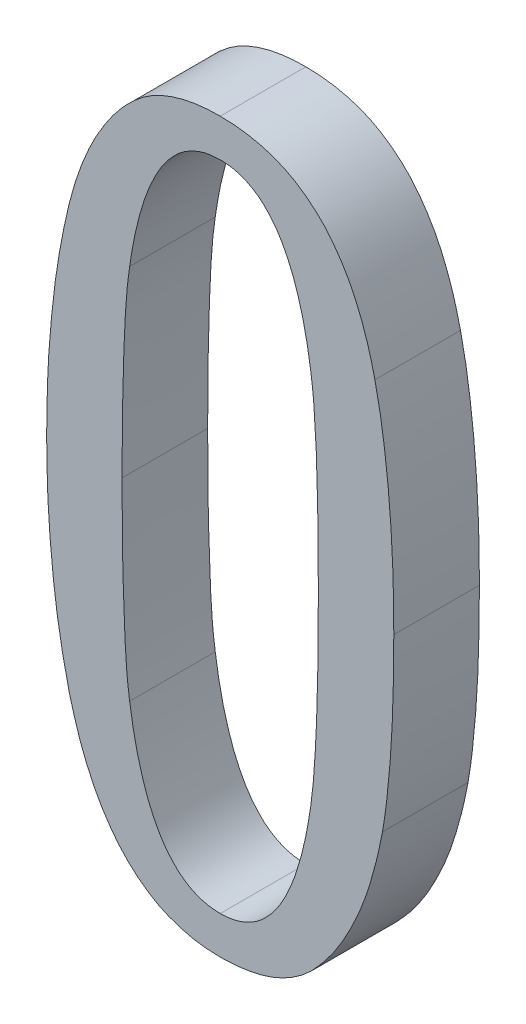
ISO-10303-21;
HEADER;
FILE_DESCRIPTION(('STEP AP214'),'2;1');
FILE_NAME('part.step','',(''),(''),'','','');
FILE_SCHEMA(('AUTOMOTIVE_DESIGN { 1 0 10303 214 1 1 1 1 }'));
ENDSEC;
DATA;
#1=APPLICATION_CONTEXT('core data for automotive mechanical design processes');
#2=APPLICATION_PROTOCOL_DEFINITION('international standard','automotive_design',2000,#1);
#3=PRODUCT_CONTEXT('',#1,'mechanical');
#4=PRODUCT('Part','Part','',(#3));
#5=PRODUCT_RELATED_PRODUCT_CATEGORY('part','',(#4));
#6=PRODUCT_DEFINITION_FORMATION('','',#4);
#7=PRODUCT_DEFINITION_CONTEXT('part definition',#1,'design');
#8=PRODUCT_DEFINITION('design','',#6,#7);
#9=PRODUCT_DEFINITION_SHAPE('','',#8);
#10=(LENGTH_UNIT() NAMED_UNIT(*) SI_UNIT(.MILLI.,.METRE.));
#11=(NAMED_UNIT(*) PLANE_ANGLE_UNIT() SI_UNIT($,.RADIAN.));
#12=(NAMED_UNIT(*) SI_UNIT($,.STERADIAN.) SOLID_ANGLE_UNIT());
#13=UNCERTAINTY_MEASURE_WITH_UNIT(LENGTH_MEASURE(1.E-05),#10,'distance_accuracy_value','');
#14=(GEOMETRIC_REPRESENTATION_CONTEXT(3) GLOBAL_UNCERTAINTY_ASSIGNED_CONTEXT((#13)) GLOBAL_UNIT_ASSIGNED_CONTEXT((#10,
#11,#12)) REPRESENTATION_CONTEXT('',''));
#15=CARTESIAN_POINT('',(0.,0.,0.));
#16=DIRECTION('',(0.,0.,1.));
#17=DIRECTION('',(1.,0.,0.));
#18=AXIS2_PLACEMENT_3D('',#15,#16,#17);
#19=CARTESIAN_POINT('',(6.70570616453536,23.7083022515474,3.));
#20=DIRECTION('',(0.,0.,1.));
#21=DIRECTION('',(1.,0.,0.));
#22=AXIS2_PLACEMENT_3D('',#19,#20,#21);
#23=PLANE('',#22);
#24=CARTESIAN_POINT('',(5.29100529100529,22.8835978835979,3.));
#25=CARTESIAN_POINT('',(5.38712644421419,22.969221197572,3.));
#26=CARTESIAN_POINT('',(5.579058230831,23.1401912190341,3.));
#27=CARTESIAN_POINT('',(5.90109528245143,23.3551879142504,3.));
#28=CARTESIAN_POINT('',(6.24559644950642,23.5381363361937,3.));
#29=CARTESIAN_POINT('',(6.61626051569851,23.6837435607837,3.));
#30=CARTESIAN_POINT('',(7.01047215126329,23.803634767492,3.));
#31=CARTESIAN_POINT('',(7.43083852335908,23.8842611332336,3.));
#32=CARTESIAN_POINT('',(7.87482346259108,23.9351039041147,3.));
#33=CARTESIAN_POINT('',(8.17804962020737,23.9395315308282,3.));
#34=CARTESIAN_POINT('',(8.33333333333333,23.9417989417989,3.));
#35=B_SPLINE_CURVE_WITH_KNOTS('',3,(#24,#25,#26,#27,#28,#29,#30,#31,#32,#33,#34),.UNSPECIFIED.,
.F.,.F.,(4,1,1,1,1,1,1,1,4),(0.,0.116837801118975,0.233298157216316,0.350774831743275,
0.470626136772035,0.594550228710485,0.724619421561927,0.858976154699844,1.),.UNSPECIFIED.);
#36=CARTESIAN_POINT('',(5.29100529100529,22.8835978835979,3.));
#37=VERTEX_POINT('',#36);
#38=CARTESIAN_POINT('',(8.33333333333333,23.9417989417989,3.));
#39=VERTEX_POINT('',#38);
#40=EDGE_CURVE('E333',#37,#39,#35,.T.);
#41=ORIENTED_EDGE('',*,*,#40,.F.);
#42=CARTESIAN_POINT('',(3.04232804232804,18.6507936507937,3.));
#43=CARTESIAN_POINT('',(3.10146166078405,18.8770110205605,3.));
#44=CARTESIAN_POINT('',(3.21690358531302,19.3186374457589,3.));
#45=CARTESIAN_POINT('',(3.43479000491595,19.9507280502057,3.));
#46=CARTESIAN_POINT('',(3.67535329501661,20.5434992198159,3.));
#47=CARTESIAN_POINT('',(3.94143997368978,21.0948392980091,3.));
#48=CARTESIAN_POINT('',(4.23985983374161,21.6034598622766,3.));
#49=CARTESIAN_POINT('',(4.55561703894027,22.075247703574,3.));
#50=CARTESIAN_POINT('',(4.90289521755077,22.5056520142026,3.));
#51=CARTESIAN_POINT('',(5.16268521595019,22.7586383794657,3.));
#52=CARTESIAN_POINT('',(5.29100529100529,22.8835978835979,3.));
#53=B_SPLINE_CURVE_WITH_KNOTS('',3,(#42,#43,#44,#45,#46,#47,#48,#49,#50,#51,#52),.UNSPECIFIED.,
.F.,.F.,(4,1,1,1,1,1,1,1,4),(0.,0.144325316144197,0.281754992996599,0.412450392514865,
0.539168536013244,0.659360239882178,0.776258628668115,0.889485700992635,1.),.UNSPECIFIED.);
#54=CARTESIAN_POINT('',(3.04232804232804,18.6507936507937,3.));
#55=VERTEX_POINT('',#54);
#56=EDGE_CURVE('E233',#55,#37,#53,.T.);
#57=ORIENTED_EDGE('',*,*,#56,.F.);
#58=CARTESIAN_POINT('',(2.24867724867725,11.2433862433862,3.));
#59=CARTESIAN_POINT('',(2.2523405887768,11.5863400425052,3.));
#60=CARTESIAN_POINT('',(2.259564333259,12.2626110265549,3.));
#61=CARTESIAN_POINT('',(2.29157095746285,13.2625863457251,3.));
#62=CARTESIAN_POINT('',(2.35604114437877,14.2329291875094,3.));
#63=CARTESIAN_POINT('',(2.44577096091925,15.1735085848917,3.));
#64=CARTESIAN_POINT('',(2.54969652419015,16.086053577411,3.));
#65=CARTESIAN_POINT('',(2.68913240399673,16.9678309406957,3.));
#66=CARTESIAN_POINT('',(2.84814490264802,17.8213495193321,3.));
#67=CARTESIAN_POINT('',(2.97820314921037,18.3768871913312,3.));
#68=CARTESIAN_POINT('',(3.04232804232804,18.6507936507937,3.));
#69=B_SPLINE_CURVE_WITH_KNOTS('',3,(#58,#59,#60,#61,#62,#63,#64,#65,#66,#67,#68),.UNSPECIFIED.,
.F.,.F.,(4,1,1,1,1,1,1,1,4),(0.,0.13778974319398,0.271707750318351,0.401890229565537,
0.52840892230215,0.651289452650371,0.770803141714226,0.886995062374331,1.),.UNSPECIFIED.);
#70=CARTESIAN_POINT('',(2.24867724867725,11.2433862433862,3.));
#71=VERTEX_POINT('',#70);
#72=EDGE_CURVE('E240',#71,#55,#69,.T.);
#73=ORIENTED_EDGE('',*,*,#72,.F.);
#74=CARTESIAN_POINT('',(3.04232804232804,3.80168528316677,3.));
#75=CARTESIAN_POINT('',(2.97818925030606,4.07886082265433,3.));
#76=CARTESIAN_POINT('',(2.84811789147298,4.64096369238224,3.));
#77=CARTESIAN_POINT('',(2.68964875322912,5.50271863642,3.));
#78=CARTESIAN_POINT('',(2.54963736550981,6.39092234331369,3.));
#79=CARTESIAN_POINT('',(2.44577529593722,7.30837310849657,3.));
#80=CARTESIAN_POINT('',(2.35628269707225,8.25223199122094,3.));
#81=CARTESIAN_POINT('',(2.29153382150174,9.22418298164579,3.));
#82=CARTESIAN_POINT('',(2.25957404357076,10.224162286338,3.));
#83=CARTESIAN_POINT('',(2.25234385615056,10.9004327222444,3.));
#84=CARTESIAN_POINT('',(2.24867724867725,11.2433862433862,3.));
#85=B_SPLINE_CURVE_WITH_KNOTS('',3,(#74,#75,#76,#77,#78,#79,#80,#81,#82,#83,#84),.UNSPECIFIED.,
.F.,.F.,(4,1,1,1,1,1,1,1,4),(0.,0.113770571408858,0.230722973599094,0.350343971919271,
0.473319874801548,0.599919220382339,0.729515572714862,0.862830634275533,1.),.UNSPECIFIED.);
#86=CARTESIAN_POINT('',(3.04232804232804,3.80168528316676,3.));
#87=VERTEX_POINT('',#86);
#88=EDGE_CURVE('E455',#87,#71,#85,.T.);
#89=ORIENTED_EDGE('',*,*,#88,.F.);
#90=CARTESIAN_POINT('',(8.33333333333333,-1.58730158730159,3.));
#91=CARTESIAN_POINT('',(8.17309460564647,-1.58391749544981,3.));
#92=CARTESIAN_POINT('',(7.85620522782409,-1.57722508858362,3.));
#93=CARTESIAN_POINT('',(7.3914557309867,-1.51275868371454,3.));
#94=CARTESIAN_POINT('',(6.94723938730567,-1.40391648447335,3.));
#95=CARTESIAN_POINT('',(6.52435764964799,-1.25574533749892,3.));
#96=CARTESIAN_POINT('',(6.11814491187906,-1.072297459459,3.));
#97=CARTESIAN_POINT('',(5.74075730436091,-0.830361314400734,3.));
#98=CARTESIAN_POINT('',(5.3768998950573,-0.558877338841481,3.));
#99=CARTESIAN_POINT('',(5.03685684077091,-0.239244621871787,3.));
#100=CARTESIAN_POINT('',(4.71167864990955,0.116592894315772,3.));
#101=CARTESIAN_POINT('',(4.41588334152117,0.523504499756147,3.));
#102=CARTESIAN_POINT('',(4.12802809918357,0.963190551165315,3.));
#103=CARTESIAN_POINT('',(3.87156759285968,1.45095805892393,3.));
#104=CARTESIAN_POINT('',(3.63034571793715,1.97723672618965,3.));
#105=CARTESIAN_POINT('',(3.40941112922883,2.54599240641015,3.));
#106=CARTESIAN_POINT('',(3.21614996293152,3.15956885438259,3.));
#107=CARTESIAN_POINT('',(3.10123685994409,3.58406992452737,3.));
#108=CARTESIAN_POINT('',(3.04232804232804,3.80168528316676,3.));
#109=B_SPLINE_CURVE_WITH_KNOTS('',3,(#90,#91,#92,#93,#94,#95,#96,#97,#98,#99,#100,#101,#102,
#103,#104,#105,#106,#107,#108),.UNSPECIFIED.,.F.,.F.,(4,1,1,1,1,1,1,1,1,1,1,1,1,1,1,1,4),(0.,
0.0584826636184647,0.115655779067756,0.170899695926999,0.225208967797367,0.279097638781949,
0.33320030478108,0.388534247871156,0.444649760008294,0.503329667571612,0.564268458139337,
0.628110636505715,0.695067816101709,0.765239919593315,0.839428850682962,0.917685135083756,1.),.UNSPECIFIED.);
#110=CARTESIAN_POINT('',(8.33333333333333,-1.58730158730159,3.));
#111=VERTEX_POINT('',#110);
#112=EDGE_CURVE('E438',#111,#87,#109,.T.);
#113=ORIENTED_EDGE('',*,*,#112,.F.);
#114=CARTESIAN_POINT('',(11.5079365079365,-0.431118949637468,3.));
#115=CARTESIAN_POINT('',(11.4071324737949,-0.523511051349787,3.));
#116=CARTESIAN_POINT('',(11.2050140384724,-0.708763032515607,3.));
#117=CARTESIAN_POINT('',(10.864424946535,-0.939937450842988,3.));
#118=CARTESIAN_POINT('',(10.5060702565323,-1.14502029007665,3.));
#119=CARTESIAN_POINT('',(10.1186919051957,-1.30615067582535,3.));
#120=CARTESIAN_POINT('',(9.70738261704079,-1.43458269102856,3.));
#121=CARTESIAN_POINT('',(9.27019431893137,-1.51983395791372,3.));
#122=CARTESIAN_POINT('',(8.80999708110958,-1.57605002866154,3.));
#123=CARTESIAN_POINT('',(8.49517919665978,-1.58348124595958,3.));
#124=CARTESIAN_POINT('',(8.33333333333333,-1.58730158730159,3.));
#125=B_SPLINE_CURVE_WITH_KNOTS('',3,(#114,#115,#116,#117,#118,#119,#120,#121,#122,#123,#124),
.UNSPECIFIED.,.F.,.F.,(4,1,1,1,1,1,1,1,4),(0.,0.118194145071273,0.236986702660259,
0.355315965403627,0.475013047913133,0.599286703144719,0.727616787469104,0.859969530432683,1.),.UNSPECIFIED.);
#126=CARTESIAN_POINT('',(11.5079365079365,-0.431118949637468,3.));
#127=VERTEX_POINT('',#126);
#128=EDGE_CURVE('E428',#127,#111,#125,.T.);
#129=ORIENTED_EDGE('',*,*,#128,.F.);
#130=CARTESIAN_POINT('',(14.021164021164,5.0607485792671,3.));
#131=CARTESIAN_POINT('',(13.96258083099,4.76762906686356,3.));
#132=CARTESIAN_POINT('',(13.8486262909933,4.19746040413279,3.));
#133=CARTESIAN_POINT('',(13.6240036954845,3.37579721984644,3.));
#134=CARTESIAN_POINT('',(13.3756770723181,2.60469801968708,3.));
#135=CARTESIAN_POINT('',(13.072075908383,1.89200816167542,3.));
#136=CARTESIAN_POINT('',(12.7409484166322,1.22924591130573,3.));
#137=CARTESIAN_POINT('',(12.374467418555,0.618887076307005,3.));
#138=CARTESIAN_POINT('',(11.9662966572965,0.0637231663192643,3.));
#139=CARTESIAN_POINT('',(11.6597204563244,-0.26725415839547,3.));
#140=CARTESIAN_POINT('',(11.5079365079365,-0.431118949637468,3.));
#141=B_SPLINE_CURVE_WITH_KNOTS('',3,(#130,#131,#132,#133,#134,#135,#136,#137,#138,#139,#140),
.UNSPECIFIED.,.F.,.F.,(4,1,1,1,1,1,1,1,4),(0.,0.146296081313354,0.284571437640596,
0.416795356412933,0.542560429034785,0.663408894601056,0.779267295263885,0.890716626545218,1.),.UNSPECIFIED.);
#142=CARTESIAN_POINT('',(14.021164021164,5.0607485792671,3.));
#143=VERTEX_POINT('',#142);
#144=EDGE_CURVE('E418',#143,#127,#141,.T.);
#145=ORIENTED_EDGE('',*,*,#144,.F.);
#146=CARTESIAN_POINT('',(14.4179894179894,11.2433862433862,3.));
#147=CARTESIAN_POINT('',(14.4175924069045,10.9249315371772,3.));
#148=CARTESIAN_POINT('',(14.4168186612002,10.3042864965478,3.));
#149=CARTESIAN_POINT('',(14.3951539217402,9.39955885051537,3.));
#150=CARTESIAN_POINT('',(14.367979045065,8.54688392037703,3.));
#151=CARTESIAN_POINT('',(14.3244280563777,7.74808456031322,3.));
#152=CARTESIAN_POINT('',(14.2648680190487,7.00178879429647,3.));
#153=CARTESIAN_POINT('',(14.1964763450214,6.30764001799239,3.));
#154=CARTESIAN_POINT('',(14.1216673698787,5.66485327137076,3.));
#155=CARTESIAN_POINT('',(14.0537289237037,5.25648942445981,3.));
#156=CARTESIAN_POINT('',(14.021164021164,5.0607485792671,3.));
#157=B_SPLINE_CURVE_WITH_KNOTS('',3,(#146,#147,#148,#149,#150,#151,#152,#153,#154,#155,#156),
.UNSPECIFIED.,.F.,.F.,(4,1,1,1,1,1,1,1,4),(0.,0.15402714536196,0.300187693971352,
0.437707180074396,0.566652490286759,0.687086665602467,0.799792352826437,0.904034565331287,1.),.UNSPECIFIED.);
#158=CARTESIAN_POINT('',(14.4179894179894,11.2433862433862,3.));
#159=VERTEX_POINT('',#158);
#160=EDGE_CURVE('E412',#159,#143,#157,.T.);
#161=ORIENTED_EDGE('',*,*,#160,.F.);
#162=CARTESIAN_POINT('',(13.7566137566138,18.6507936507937,3.));
#163=CARTESIAN_POINT('',(13.8111762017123,18.3964788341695,3.));
#164=CARTESIAN_POINT('',(13.923361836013,17.873583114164,3.));
#165=CARTESIAN_POINT('',(14.0510187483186,17.0602784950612,3.));
#166=CARTESIAN_POINT('',(14.1642109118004,16.2027261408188,3.));
#167=CARTESIAN_POINT('',(14.2568370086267,15.2992500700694,3.));
#168=CARTESIAN_POINT('',(14.3292473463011,14.3501203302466,3.));
#169=CARTESIAN_POINT('',(14.3841461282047,13.3554489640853,3.));
#170=CARTESIAN_POINT('',(14.4123119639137,12.3148196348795,3.));
#171=CARTESIAN_POINT('',(14.4160683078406,11.6059328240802,3.));
#172=CARTESIAN_POINT('',(14.4179894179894,11.2433862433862,3.));
#173=B_SPLINE_CURVE_WITH_KNOTS('',3,(#162,#163,#164,#165,#166,#167,#168,#169,#170,#171,#172),
.UNSPECIFIED.,.F.,.F.,(4,1,1,1,1,1,1,1,4),(0.,0.104707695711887,0.215289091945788,
0.331343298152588,0.452968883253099,0.580907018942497,0.714577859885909,0.854026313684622,1.),.UNSPECIFIED.);
#174=CARTESIAN_POINT('',(13.7566137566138,18.6507936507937,3.));
#175=VERTEX_POINT('',#174);
#176=EDGE_CURVE('E379',#175,#159,#173,.T.);
#177=ORIENTED_EDGE('',*,*,#176,.F.);
#178=CARTESIAN_POINT('',(8.33333333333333,23.9417989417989,3.));
#179=CARTESIAN_POINT('',(8.50666388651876,23.9387479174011,3.));
#180=CARTESIAN_POINT('',(8.84477249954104,23.932796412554,3.));
#181=CARTESIAN_POINT('',(9.33958897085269,23.8654089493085,3.));
#182=CARTESIAN_POINT('',(9.81026725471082,23.7638582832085,3.));
#183=CARTESIAN_POINT('',(10.2595231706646,23.6226580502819,3.));
#184=CARTESIAN_POINT('',(10.6841825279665,23.4339184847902,3.));
#185=CARTESIAN_POINT('',(11.0855142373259,23.205052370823,3.));
#186=CARTESIAN_POINT('',(11.4604886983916,22.930869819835,3.));
#187=CARTESIAN_POINT('',(11.8158069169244,22.6221606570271,3.));
#188=CARTESIAN_POINT('',(12.1437942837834,22.2687753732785,3.));
#189=CARTESIAN_POINT('',(12.4428248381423,21.8721266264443,3.));
#190=CARTESIAN_POINT('',(12.7231567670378,21.4385286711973,3.));
#191=CARTESIAN_POINT('',(12.9846407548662,20.9639741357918,3.));
#192=CARTESIAN_POINT('',(13.2104343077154,20.4413501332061,3.));
#193=CARTESIAN_POINT('',(13.4239584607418,19.8840661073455,3.));
#194=CARTESIAN_POINT('',(13.603610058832,19.2819500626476,3.));
#195=CARTESIAN_POINT('',(13.7046371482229,18.8652026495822,3.));
#196=CARTESIAN_POINT('',(13.7566137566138,18.6507936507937,3.));
#197=B_SPLINE_CURVE_WITH_KNOTS('',3,(#178,#179,#180,#181,#182,#183,#184,#185,#186,#187,#188,
#189,#190,#191,#192,#193,#194,#195,#196),.UNSPECIFIED.,.F.,.F.,(4,1,1,1,1,1,1,1,1,1,1,1,1,1,1,1,
4),(0.,0.0626395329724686,0.122188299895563,0.180218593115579,0.236618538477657,
0.292139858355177,0.347952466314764,0.403351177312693,0.459846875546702,0.517925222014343,
0.577333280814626,0.63924769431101,0.704520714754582,0.772992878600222,0.844941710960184,
0.920225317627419,1.),.UNSPECIFIED.);
#198=EDGE_CURVE('E376',#39,#175,#197,.T.);
#199=ORIENTED_EDGE('',*,*,#198,.F.);
#200=EDGE_LOOP('',(#41,#57,#73,#89,#113,#129,#145,#161,#177,#199));
#201=FACE_BOUND('',#200,.T.);
#202=CARTESIAN_POINT('',(8.33333333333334,-0.264550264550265,3.));
#203=CARTESIAN_POINT('',(8.43491832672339,-0.261050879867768,3.));
#204=CARTESIAN_POINT('',(8.63494746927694,-0.254160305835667,3.));
#205=CARTESIAN_POINT('',(8.92584610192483,-0.19161095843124,3.));
#206=CARTESIAN_POINT('',(9.20400210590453,-0.100088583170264,3.));
#207=CARTESIAN_POINT('',(9.46639085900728,0.0362471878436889,3.));
#208=CARTESIAN_POINT('',(9.71753440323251,0.206103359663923,3.));
#209=CARTESIAN_POINT('',(9.94727835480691,0.422677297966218,3.));
#210=CARTESIAN_POINT('',(10.1703467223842,0.667523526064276,3.));
#211=CARTESIAN_POINT('',(10.3754299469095,0.954487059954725,3.));
#212=CARTESIAN_POINT('',(10.5669930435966,1.27918444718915,3.));
#213=CARTESIAN_POINT('',(10.7400072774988,1.64347158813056,3.));
#214=CARTESIAN_POINT('',(10.9103159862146,2.03999433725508,3.));
#215=CARTESIAN_POINT('',(11.0530555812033,2.47949386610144,3.));
#216=CARTESIAN_POINT('',(11.1920345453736,2.95414135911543,3.));
#217=CARTESIAN_POINT('',(11.3122491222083,3.4680146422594,3.));
#218=CARTESIAN_POINT('',(11.4213373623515,4.0185219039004,3.));
#219=CARTESIAN_POINT('',(11.4784756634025,4.39910512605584,3.));
#220=CARTESIAN_POINT('',(11.5079365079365,4.59533607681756,3.));
#221=B_SPLINE_CURVE_WITH_KNOTS('',3,(#202,#203,#204,#205,#206,#207,#208,#209,#210,#211,#212,
#213,#214,#215,#216,#217,#218,#219,#220),.UNSPECIFIED.,.F.,.F.,(4,1,1,1,1,1,1,1,1,1,1,1,1,1,1,1,
4),(0.,0.0481380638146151,0.0947877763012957,0.140606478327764,0.18669299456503,
0.234618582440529,0.283975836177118,0.336095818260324,0.391579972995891,0.450978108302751,
0.514738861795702,0.582803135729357,0.655573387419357,0.733798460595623,0.817427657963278,
0.905864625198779,1.),.UNSPECIFIED.);
#222=CARTESIAN_POINT('',(8.33333333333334,-0.264550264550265,3.));
#223=VERTEX_POINT('',#222);
#224=CARTESIAN_POINT('',(11.5079365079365,4.59533607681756,3.));
#225=VERTEX_POINT('',#224);
#226=EDGE_CURVE('E176',#223,#225,#221,.T.);
#227=ORIENTED_EDGE('',*,*,#226,.F.);
#228=CARTESIAN_POINT('',(5.15873015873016,4.59533607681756,3.));
#229=CARTESIAN_POINT('',(5.18819100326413,4.39910512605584,3.));
#230=CARTESIAN_POINT('',(5.24532930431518,4.0185219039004,3.));
#231=CARTESIAN_POINT('',(5.35441754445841,3.4680146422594,3.));
#232=CARTESIAN_POINT('',(5.47463212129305,2.95414135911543,3.));
#233=CARTESIAN_POINT('',(5.61361108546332,2.47949386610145,3.));
#234=CARTESIAN_POINT('',(5.75635068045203,2.03999433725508,3.));
#235=CARTESIAN_POINT('',(5.92665938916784,1.64347158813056,3.));
#236=CARTESIAN_POINT('',(6.09967362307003,1.27918444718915,3.));
#237=CARTESIAN_POINT('',(6.29123671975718,0.954487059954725,3.));
#238=CARTESIAN_POINT('',(6.4963199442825,0.667523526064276,3.));
#239=CARTESIAN_POINT('',(6.71938831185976,0.422677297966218,3.));
#240=CARTESIAN_POINT('',(6.94913226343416,0.206103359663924,3.));
#241=CARTESIAN_POINT('',(7.20027580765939,0.036247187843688,3.));
#242=CARTESIAN_POINT('',(7.46266456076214,-0.100088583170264,3.));
#243=CARTESIAN_POINT('',(7.74082056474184,-0.191610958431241,3.));
#244=CARTESIAN_POINT('',(8.03171919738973,-0.254160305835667,3.));
#245=CARTESIAN_POINT('',(8.23174833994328,-0.261050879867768,3.));
#246=CARTESIAN_POINT('',(8.33333333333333,-0.264550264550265,3.));
#247=B_SPLINE_CURVE_WITH_KNOTS('',3,(#228,#229,#230,#231,#232,#233,#234,#235,#236,#237,#238,
#239,#240,#241,#242,#243,#244,#245,#246),.UNSPECIFIED.,.F.,.F.,(4,1,1,1,1,1,1,1,1,1,1,1,1,1,1,1,
4),(0.,0.0941353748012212,0.182572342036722,0.266201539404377,0.344426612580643,
0.417196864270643,0.485261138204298,0.549021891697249,0.608420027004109,0.663904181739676,
0.716024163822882,0.765381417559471,0.81330700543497,0.859393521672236,0.905212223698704,
0.951861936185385,1.),.UNSPECIFIED.);
#248=CARTESIAN_POINT('',(5.15873015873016,4.59533607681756,3.));
#249=VERTEX_POINT('',#248);
#250=EDGE_CURVE('E167',#249,#223,#247,.T.);
#251=ORIENTED_EDGE('',*,*,#250,.F.);
#252=CARTESIAN_POINT('',(4.89417989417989,11.2433862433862,3.));
#253=CARTESIAN_POINT('',(4.89569915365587,10.8514629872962,3.));
#254=CARTESIAN_POINT('',(4.89860478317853,10.101897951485,3.));
#255=CARTESIAN_POINT('',(4.9045693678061,9.02558274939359,3.));
#256=CARTESIAN_POINT('',(4.93164527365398,8.04744533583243,3.));
#257=CARTESIAN_POINT('',(4.96024331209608,7.16720650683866,3.));
#258=CARTESIAN_POINT('',(4.99275884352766,6.38472273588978,3.));
#259=CARTESIAN_POINT('',(5.03613569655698,5.70192831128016,3.));
#260=CARTESIAN_POINT('',(5.0871135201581,5.11500557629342,3.));
#261=CARTESIAN_POINT('',(5.13624527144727,4.75849243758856,3.));
#262=CARTESIAN_POINT('',(5.15873015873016,4.59533607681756,3.));
#263=B_SPLINE_CURVE_WITH_KNOTS('',3,(#252,#253,#254,#255,#256,#257,#258,#259,#260,#261,#262),
.UNSPECIFIED.,.F.,.F.,(4,1,1,1,1,1,1,1,4),(0.,0.176606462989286,0.337765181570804,
0.484981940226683,0.617509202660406,0.734623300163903,0.837855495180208,0.925795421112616,1.),.UNSPECIFIED.);
#264=CARTESIAN_POINT('',(4.89417989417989,11.2433862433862,3.));
#265=VERTEX_POINT('',#264);
#266=EDGE_CURVE('E626',#265,#249,#263,.T.);
#267=ORIENTED_EDGE('',*,*,#266,.F.);
#268=CARTESIAN_POINT('',(5.15873015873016,17.7934548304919,3.));
#269=CARTESIAN_POINT('',(5.13616644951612,17.6368440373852,3.));
#270=CARTESIAN_POINT('',(5.08623176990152,17.2902560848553,3.));
#271=CARTESIAN_POINT('',(5.03648014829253,16.7178656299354,3.));
#272=CARTESIAN_POINT('',(4.99244601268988,16.0465564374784,3.));
#273=CARTESIAN_POINT('',(4.9603966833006,15.2771005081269,3.));
#274=CARTESIAN_POINT('',(4.9315816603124,14.4099376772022,3.));
#275=CARTESIAN_POINT('',(4.90446990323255,13.4432292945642,3.));
#276=CARTESIAN_POINT('',(4.89863985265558,12.3767090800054,3.));
#277=CARTESIAN_POINT('',(4.89570937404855,11.6320433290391,3.));
#278=CARTESIAN_POINT('',(4.89417989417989,11.2433862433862,3.));
#279=B_SPLINE_CURVE_WITH_KNOTS('',3,(#268,#269,#270,#271,#272,#273,#274,#275,#276,#277,#278),
.UNSPECIFIED.,.F.,.F.,(4,1,1,1,1,1,1,1,4),(0.,0.0723486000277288,0.160111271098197,
0.262645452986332,0.380011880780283,0.512274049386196,0.659443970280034,0.82225647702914,1.),.UNSPECIFIED.);
#280=CARTESIAN_POINT('',(5.15873015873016,17.7934548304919,3.));
#281=VERTEX_POINT('',#280);
#282=EDGE_CURVE('E632',#281,#265,#279,.T.);
#283=ORIENTED_EDGE('',*,*,#282,.F.);
#284=CARTESIAN_POINT('',(8.33333333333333,22.6190476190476,3.));
#285=CARTESIAN_POINT('',(8.23190119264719,22.6148584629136,3.));
#286=CARTESIAN_POINT('',(8.03248536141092,22.6066225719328,3.));
#287=CARTESIAN_POINT('',(7.73916870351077,22.5539834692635,3.));
#288=CARTESIAN_POINT('',(7.46359341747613,22.4530665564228,3.));
#289=CARTESIAN_POINT('',(7.20167521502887,22.3181059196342,3.));
#290=CARTESIAN_POINT('',(6.9476727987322,22.1537809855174,3.));
#291=CARTESIAN_POINT('',(6.71943397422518,21.9365275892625,3.));
#292=CARTESIAN_POINT('',(6.49793755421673,21.6923731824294,3.));
#293=CARTESIAN_POINT('',(6.28946806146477,21.4094198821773,3.));
#294=CARTESIAN_POINT('',(6.10134484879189,21.0858642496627,3.));
#295=CARTESIAN_POINT('',(5.92511213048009,20.724853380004,3.));
#296=CARTESIAN_POINT('',(5.7576077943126,20.3303574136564,3.));
#297=CARTESIAN_POINT('',(5.61331020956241,19.8947515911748,3.));
#298=CARTESIAN_POINT('',(5.47474214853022,19.4248473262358,3.));
#299=CARTESIAN_POINT('',(5.35371220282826,18.9144092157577,3.));
#300=CARTESIAN_POINT('',(5.24591197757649,18.3669023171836,3.));
#301=CARTESIAN_POINT('',(5.18831174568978,17.9880307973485,3.));
#302=CARTESIAN_POINT('',(5.15873015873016,17.7934548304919,3.));
#303=B_SPLINE_CURVE_WITH_KNOTS('',3,(#284,#285,#286,#287,#288,#289,#290,#291,#292,#293,#294,
#295,#296,#297,#298,#299,#300,#301,#302),.UNSPECIFIED.,.F.,.F.,(4,1,1,1,1,1,1,1,1,1,1,1,1,1,1,1,
4),(0.,0.0483627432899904,0.0950812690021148,0.141369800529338,0.187671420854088,
0.235384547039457,0.28497217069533,0.337335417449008,0.392449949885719,0.452125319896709,
0.515484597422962,0.58386655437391,0.656239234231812,0.734081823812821,0.817344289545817,
0.906194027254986,1.),.UNSPECIFIED.);
#304=CARTESIAN_POINT('',(8.33333333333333,22.6190476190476,3.));
#305=VERTEX_POINT('',#304);
#306=EDGE_CURVE('E730',#305,#281,#303,.T.);
#307=ORIENTED_EDGE('',*,*,#306,.F.);
#308=CARTESIAN_POINT('',(11.5079365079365,17.7934548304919,3.));
#309=CARTESIAN_POINT('',(11.4783549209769,17.9880307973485,3.));
#310=CARTESIAN_POINT('',(11.4207546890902,18.3669023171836,3.));
#311=CARTESIAN_POINT('',(11.3129544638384,18.9144092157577,3.));
#312=CARTESIAN_POINT('',(11.1919245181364,19.4248473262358,3.));
#313=CARTESIAN_POINT('',(11.0533564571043,19.8947515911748,3.));
#314=CARTESIAN_POINT('',(10.9090588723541,20.3303574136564,3.));
#315=CARTESIAN_POINT('',(10.7415545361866,20.724853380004,3.));
#316=CARTESIAN_POINT('',(10.5653218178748,21.0858642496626,3.));
#317=CARTESIAN_POINT('',(10.3771986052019,21.4094198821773,3.));
#318=CARTESIAN_POINT('',(10.1687291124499,21.6923731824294,3.));
#319=CARTESIAN_POINT('',(9.94723269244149,21.9365275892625,3.));
#320=CARTESIAN_POINT('',(9.71899386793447,22.1537809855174,3.));
#321=CARTESIAN_POINT('',(9.4649914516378,22.3181059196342,3.));
#322=CARTESIAN_POINT('',(9.20307324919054,22.4530665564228,3.));
#323=CARTESIAN_POINT('',(8.9274979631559,22.5539834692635,3.));
#324=CARTESIAN_POINT('',(8.63418130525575,22.6066225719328,3.));
#325=CARTESIAN_POINT('',(8.43476547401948,22.6148584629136,3.));
#326=CARTESIAN_POINT('',(8.33333333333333,22.6190476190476,3.));
#327=B_SPLINE_CURVE_WITH_KNOTS('',3,(#308,#309,#310,#311,#312,#313,#314,#315,#316,#317,#318,
#319,#320,#321,#322,#323,#324,#325,#326),.UNSPECIFIED.,.F.,.F.,(4,1,1,1,1,1,1,1,1,1,1,1,1,1,1,1,
4),(0.,0.0938059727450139,0.182655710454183,0.265918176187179,0.343760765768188,
0.41613344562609,0.484515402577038,0.547874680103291,0.607550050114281,0.662664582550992,
0.71502782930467,0.764615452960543,0.812328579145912,0.858630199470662,0.904918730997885,
0.95163725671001,1.),.UNSPECIFIED.);
#328=CARTESIAN_POINT('',(11.5079365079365,17.7934548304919,3.));
#329=VERTEX_POINT('',#328);
#330=EDGE_CURVE('E734',#329,#305,#327,.T.);
#331=ORIENTED_EDGE('',*,*,#330,.F.);
#332=CARTESIAN_POINT('',(11.7724867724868,11.2433862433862,3.));
#333=CARTESIAN_POINT('',(11.770890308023,11.6255085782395,3.));
#334=CARTESIAN_POINT('',(11.7678337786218,12.3571052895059,3.));
#335=CARTESIAN_POINT('',(11.7628616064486,13.4089635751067,3.));
#336=CARTESIAN_POINT('',(11.7324450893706,14.3657016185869,3.));
#337=CARTESIAN_POINT('',(11.7146100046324,15.2316469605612,3.));
#338=CARTESIAN_POINT('',(11.6720786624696,16.0039113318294,3.));
#339=CARTESIAN_POINT('',(11.6307904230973,16.6836099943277,3.));
#340=CARTESIAN_POINT('',(11.5791265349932,17.2704691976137,3.));
#341=CARTESIAN_POINT('',(11.5303687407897,17.6286601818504,3.));
#342=CARTESIAN_POINT('',(11.5079365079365,17.7934548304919,3.));
#343=B_SPLINE_CURVE_WITH_KNOTS('',3,(#332,#333,#334,#335,#336,#337,#338,#339,#340,#341,#342),
.UNSPECIFIED.,.F.,.F.,(4,1,1,1,1,1,1,1,4),(0.,0.174761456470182,0.334591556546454,
0.481019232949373,0.612515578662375,0.730666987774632,0.834694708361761,0.923947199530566,1.),.UNSPECIFIED.);
#344=CARTESIAN_POINT('',(11.7724867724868,11.2433862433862,3.));
#345=VERTEX_POINT('',#344);
#346=EDGE_CURVE('E194',#345,#329,#343,.T.);
#347=ORIENTED_EDGE('',*,*,#346,.F.);
#348=CARTESIAN_POINT('',(11.5079365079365,4.59533607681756,3.));
#349=CARTESIAN_POINT('',(11.5303931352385,4.76503190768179,3.));
#350=CARTESIAN_POINT('',(11.5793091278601,5.13467067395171,3.));
#351=CARTESIAN_POINT('',(11.630216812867,5.73626666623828,3.));
#352=CARTESIAN_POINT('',(11.6721436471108,6.42896825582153,3.));
#353=CARTESIAN_POINT('',(11.7146789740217,7.21267145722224,3.));
#354=CARTESIAN_POINT('',(11.7323345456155,8.09004539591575,3.));
#355=CARTESIAN_POINT('',(11.7629231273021,9.05984663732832,3.));
#356=CARTESIAN_POINT('',(11.7677902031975,10.1215022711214,3.));
#357=CARTESIAN_POINT('',(11.7708802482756,10.8596308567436,3.));
#358=CARTESIAN_POINT('',(11.7724867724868,11.2433862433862,3.));
#359=B_SPLINE_CURVE_WITH_KNOTS('',3,(#348,#349,#350,#351,#352,#353,#354,#355,#356,#357,#358),
.UNSPECIFIED.,.F.,.F.,(4,1,1,1,1,1,1,1,4),(0.,0.0771263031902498,0.16799983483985,
0.271968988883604,0.389855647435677,0.521628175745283,0.667377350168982,0.827068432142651,1.),.UNSPECIFIED.);
#360=EDGE_CURVE('E190',#225,#345,#359,.T.);
#361=ORIENTED_EDGE('',*,*,#360,.F.);
#362=EDGE_LOOP('',(#227,#251,#267,#283,#307,#331,#347,#361));
#363=FACE_BOUND('',#362,.T.);
#364=ADVANCED_FACE('F39',(#201,#363),#23,.T.);
#365=CARTESIAN_POINT('',(6.70570616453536,23.7083022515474,0.));
#366=DIRECTION('',(0.,0.,1.));
#367=DIRECTION('',(1.,0.,0.));
#368=AXIS2_PLACEMENT_3D('',#365,#366,#367);
#369=PLANE('',#368);
#370=CARTESIAN_POINT('',(5.29100529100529,22.8835978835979,0.));
#371=CARTESIAN_POINT('',(5.38712644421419,22.969221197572,0.));
#372=CARTESIAN_POINT('',(5.579058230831,23.1401912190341,0.));
#373=CARTESIAN_POINT('',(5.90109528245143,23.3551879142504,0.));
#374=CARTESIAN_POINT('',(6.24559644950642,23.5381363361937,0.));
#375=CARTESIAN_POINT('',(6.61626051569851,23.6837435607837,0.));
#376=CARTESIAN_POINT('',(7.01047215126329,23.803634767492,0.));
#377=CARTESIAN_POINT('',(7.43083852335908,23.8842611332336,0.));
#378=CARTESIAN_POINT('',(7.87482346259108,23.9351039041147,0.));
#379=CARTESIAN_POINT('',(8.17804962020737,23.9395315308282,0.));
#380=CARTESIAN_POINT('',(8.33333333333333,23.9417989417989,0.));
#381=B_SPLINE_CURVE_WITH_KNOTS('',3,(#370,#371,#372,#373,#374,#375,#376,#377,#378,#379,#380),
.UNSPECIFIED.,.F.,.F.,(4,1,1,1,1,1,1,1,4),(0.,0.116837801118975,0.233298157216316,
0.350774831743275,0.470626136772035,0.594550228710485,0.724619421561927,0.858976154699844,1.),.UNSPECIFIED.);
#382=CARTESIAN_POINT('',(5.29100529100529,22.8835978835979,0.));
#383=VERTEX_POINT('',#382);
#384=CARTESIAN_POINT('',(8.33333333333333,23.9417989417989,0.));
#385=VERTEX_POINT('',#384);
#386=EDGE_CURVE('E185',#383,#385,#381,.T.);
#387=ORIENTED_EDGE('',*,*,#386,.T.);
#388=CARTESIAN_POINT('',(8.33333333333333,23.9417989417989,0.));
#389=CARTESIAN_POINT('',(8.50666388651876,23.9387479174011,0.));
#390=CARTESIAN_POINT('',(8.84477249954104,23.932796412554,0.));
#391=CARTESIAN_POINT('',(9.33958897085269,23.8654089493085,0.));
#392=CARTESIAN_POINT('',(9.81026725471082,23.7638582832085,0.));
#393=CARTESIAN_POINT('',(10.2595231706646,23.6226580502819,0.));
#394=CARTESIAN_POINT('',(10.6841825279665,23.4339184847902,0.));
#395=CARTESIAN_POINT('',(11.0855142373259,23.205052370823,0.));
#396=CARTESIAN_POINT('',(11.4604886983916,22.930869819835,0.));
#397=CARTESIAN_POINT('',(11.8158069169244,22.6221606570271,0.));
#398=CARTESIAN_POINT('',(12.1437942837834,22.2687753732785,0.));
#399=CARTESIAN_POINT('',(12.4428248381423,21.8721266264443,0.));
#400=CARTESIAN_POINT('',(12.7231567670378,21.4385286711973,0.));
#401=CARTESIAN_POINT('',(12.9846407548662,20.9639741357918,0.));
#402=CARTESIAN_POINT('',(13.2104343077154,20.4413501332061,0.));
#403=CARTESIAN_POINT('',(13.4239584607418,19.8840661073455,0.));
#404=CARTESIAN_POINT('',(13.603610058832,19.2819500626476,0.));
#405=CARTESIAN_POINT('',(13.7046371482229,18.8652026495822,0.));
#406=CARTESIAN_POINT('',(13.7566137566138,18.6507936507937,0.));
#407=B_SPLINE_CURVE_WITH_KNOTS('',3,(#388,#389,#390,#391,#392,#393,#394,#395,#396,#397,#398,
#399,#400,#401,#402,#403,#404,#405,#406),.UNSPECIFIED.,.F.,.F.,(4,1,1,1,1,1,1,1,1,1,1,1,1,1,1,1,
4),(0.,0.0626395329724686,0.122188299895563,0.180218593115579,0.236618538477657,
0.292139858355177,0.347952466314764,0.403351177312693,0.459846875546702,0.517925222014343,
0.577333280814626,0.63924769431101,0.704520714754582,0.772992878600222,0.844941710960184,
0.920225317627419,1.),.UNSPECIFIED.);
#408=CARTESIAN_POINT('',(13.7566137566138,18.6507936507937,0.));
#409=VERTEX_POINT('',#408);
#410=EDGE_CURVE('E253',#385,#409,#407,.T.);
#411=ORIENTED_EDGE('',*,*,#410,.T.);
#412=CARTESIAN_POINT('',(13.7566137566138,18.6507936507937,0.));
#413=CARTESIAN_POINT('',(13.8111762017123,18.3964788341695,0.));
#414=CARTESIAN_POINT('',(13.923361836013,17.873583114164,0.));
#415=CARTESIAN_POINT('',(14.0510187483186,17.0602784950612,0.));
#416=CARTESIAN_POINT('',(14.1642109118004,16.2027261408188,0.));
#417=CARTESIAN_POINT('',(14.2568370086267,15.2992500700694,0.));
#418=CARTESIAN_POINT('',(14.3292473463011,14.3501203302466,0.));
#419=CARTESIAN_POINT('',(14.3841461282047,13.3554489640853,0.));
#420=CARTESIAN_POINT('',(14.4123119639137,12.3148196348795,0.));
#421=CARTESIAN_POINT('',(14.4160683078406,11.6059328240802,0.));
#422=CARTESIAN_POINT('',(14.4179894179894,11.2433862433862,0.));
#423=B_SPLINE_CURVE_WITH_KNOTS('',3,(#412,#413,#414,#415,#416,#417,#418,#419,#420,#421,#422),
.UNSPECIFIED.,.F.,.F.,(4,1,1,1,1,1,1,1,4),(0.,0.104707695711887,0.215289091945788,
0.331343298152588,0.452968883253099,0.580907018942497,0.714577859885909,0.854026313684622,1.),.UNSPECIFIED.);
#424=CARTESIAN_POINT('',(14.4179894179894,11.2433862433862,0.));
#425=VERTEX_POINT('',#424);
#426=EDGE_CURVE('E262',#409,#425,#423,.T.);
#427=ORIENTED_EDGE('',*,*,#426,.T.);
#428=CARTESIAN_POINT('',(14.4179894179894,11.2433862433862,0.));
#429=CARTESIAN_POINT('',(14.4175924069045,10.9249315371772,0.));
#430=CARTESIAN_POINT('',(14.4168186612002,10.3042864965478,0.));
#431=CARTESIAN_POINT('',(14.3951539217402,9.39955885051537,0.));
#432=CARTESIAN_POINT('',(14.367979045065,8.54688392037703,0.));
#433=CARTESIAN_POINT('',(14.3244280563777,7.74808456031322,0.));
#434=CARTESIAN_POINT('',(14.2648680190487,7.00178879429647,0.));
#435=CARTESIAN_POINT('',(14.1964763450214,6.30764001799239,0.));
#436=CARTESIAN_POINT('',(14.1216673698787,5.66485327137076,0.));
#437=CARTESIAN_POINT('',(14.0537289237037,5.25648942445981,0.));
#438=CARTESIAN_POINT('',(14.021164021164,5.0607485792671,0.));
#439=B_SPLINE_CURVE_WITH_KNOTS('',3,(#428,#429,#430,#431,#432,#433,#434,#435,#436,#437,#438),
.UNSPECIFIED.,.F.,.F.,(4,1,1,1,1,1,1,1,4),(0.,0.15402714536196,0.300187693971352,
0.437707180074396,0.566652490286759,0.687086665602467,0.799792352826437,0.904034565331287,1.),.UNSPECIFIED.);
#440=CARTESIAN_POINT('',(14.021164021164,5.0607485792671,0.));
#441=VERTEX_POINT('',#440);
#442=EDGE_CURVE('E271',#425,#441,#439,.T.);
#443=ORIENTED_EDGE('',*,*,#442,.T.);
#444=CARTESIAN_POINT('',(14.021164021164,5.0607485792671,0.));
#445=CARTESIAN_POINT('',(13.96258083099,4.76762906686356,0.));
#446=CARTESIAN_POINT('',(13.8486262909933,4.19746040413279,0.));
#447=CARTESIAN_POINT('',(13.6240036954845,3.37579721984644,0.));
#448=CARTESIAN_POINT('',(13.3756770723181,2.60469801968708,0.));
#449=CARTESIAN_POINT('',(13.072075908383,1.89200816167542,0.));
#450=CARTESIAN_POINT('',(12.7409484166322,1.22924591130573,0.));
#451=CARTESIAN_POINT('',(12.374467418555,0.618887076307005,0.));
#452=CARTESIAN_POINT('',(11.9662966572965,0.0637231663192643,0.));
#453=CARTESIAN_POINT('',(11.6597204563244,-0.26725415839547,0.));
#454=CARTESIAN_POINT('',(11.5079365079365,-0.431118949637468,0.));
#455=B_SPLINE_CURVE_WITH_KNOTS('',3,(#444,#445,#446,#447,#448,#449,#450,#451,#452,#453,#454),
.UNSPECIFIED.,.F.,.F.,(4,1,1,1,1,1,1,1,4),(0.,0.146296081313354,0.284571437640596,
0.416795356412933,0.542560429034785,0.663408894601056,0.779267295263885,0.890716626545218,1.),.UNSPECIFIED.);
#456=CARTESIAN_POINT('',(11.5079365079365,-0.431118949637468,0.));
#457=VERTEX_POINT('',#456);
#458=EDGE_CURVE('E280',#441,#457,#455,.T.);
#459=ORIENTED_EDGE('',*,*,#458,.T.);
#460=CARTESIAN_POINT('',(11.5079365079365,-0.431118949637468,0.));
#461=CARTESIAN_POINT('',(11.4071324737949,-0.523511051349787,0.));
#462=CARTESIAN_POINT('',(11.2050140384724,-0.708763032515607,0.));
#463=CARTESIAN_POINT('',(10.864424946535,-0.939937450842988,0.));
#464=CARTESIAN_POINT('',(10.5060702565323,-1.14502029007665,0.));
#465=CARTESIAN_POINT('',(10.1186919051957,-1.30615067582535,0.));
#466=CARTESIAN_POINT('',(9.70738261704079,-1.43458269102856,0.));
#467=CARTESIAN_POINT('',(9.27019431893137,-1.51983395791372,0.));
#468=CARTESIAN_POINT('',(8.80999708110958,-1.57605002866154,0.));
#469=CARTESIAN_POINT('',(8.49517919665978,-1.58348124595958,0.));
#470=CARTESIAN_POINT('',(8.33333333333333,-1.58730158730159,0.));
#471=B_SPLINE_CURVE_WITH_KNOTS('',3,(#460,#461,#462,#463,#464,#465,#466,#467,#468,#469,#470),
.UNSPECIFIED.,.F.,.F.,(4,1,1,1,1,1,1,1,4),(0.,0.118194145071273,0.236986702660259,
0.355315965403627,0.475013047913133,0.599286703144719,0.727616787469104,0.859969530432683,1.),.UNSPECIFIED.);
#472=CARTESIAN_POINT('',(8.33333333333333,-1.58730158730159,0.));
#473=VERTEX_POINT('',#472);
#474=EDGE_CURVE('E289',#457,#473,#471,.T.);
#475=ORIENTED_EDGE('',*,*,#474,.T.);
#476=CARTESIAN_POINT('',(8.33333333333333,-1.58730158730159,0.));
#477=CARTESIAN_POINT('',(8.17309460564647,-1.58391749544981,0.));
#478=CARTESIAN_POINT('',(7.85620522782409,-1.57722508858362,0.));
#479=CARTESIAN_POINT('',(7.3914557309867,-1.51275868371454,0.));
#480=CARTESIAN_POINT('',(6.94723938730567,-1.40391648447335,0.));
#481=CARTESIAN_POINT('',(6.52435764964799,-1.25574533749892,0.));
#482=CARTESIAN_POINT('',(6.11814491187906,-1.072297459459,0.));
#483=CARTESIAN_POINT('',(5.74075730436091,-0.830361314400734,0.));
#484=CARTESIAN_POINT('',(5.3768998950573,-0.558877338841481,0.));
#485=CARTESIAN_POINT('',(5.03685684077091,-0.239244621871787,0.));
#486=CARTESIAN_POINT('',(4.71167864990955,0.116592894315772,0.));
#487=CARTESIAN_POINT('',(4.41588334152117,0.523504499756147,0.));
#488=CARTESIAN_POINT('',(4.12802809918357,0.963190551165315,0.));
#489=CARTESIAN_POINT('',(3.87156759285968,1.45095805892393,0.));
#490=CARTESIAN_POINT('',(3.63034571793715,1.97723672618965,0.));
#491=CARTESIAN_POINT('',(3.40941112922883,2.54599240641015,0.));
#492=CARTESIAN_POINT('',(3.21614996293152,3.15956885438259,0.));
#493=CARTESIAN_POINT('',(3.10123685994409,3.58406992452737,0.));
#494=CARTESIAN_POINT('',(3.04232804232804,3.80168528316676,0.));
#495=B_SPLINE_CURVE_WITH_KNOTS('',3,(#476,#477,#478,#479,#480,#481,#482,#483,#484,#485,#486,
#487,#488,#489,#490,#491,#492,#493,#494),.UNSPECIFIED.,.F.,.F.,(4,1,1,1,1,1,1,1,1,1,1,1,1,1,1,1,
4),(0.,0.0584826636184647,0.115655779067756,0.170899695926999,0.225208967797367,
0.279097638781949,0.33320030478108,0.388534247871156,0.444649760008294,0.503329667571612,
0.564268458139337,0.628110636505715,0.695067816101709,0.765239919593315,0.839428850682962,
0.917685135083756,1.),.UNSPECIFIED.);
#496=CARTESIAN_POINT('',(3.04232804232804,3.80168528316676,0.));
#497=VERTEX_POINT('',#496);
#498=EDGE_CURVE('E298',#473,#497,#495,.T.);
#499=ORIENTED_EDGE('',*,*,#498,.T.);
#500=CARTESIAN_POINT('',(3.04232804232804,3.80168528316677,0.));
#501=CARTESIAN_POINT('',(2.97818925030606,4.07886082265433,0.));
#502=CARTESIAN_POINT('',(2.84811789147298,4.64096369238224,0.));
#503=CARTESIAN_POINT('',(2.68964875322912,5.50271863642,0.));
#504=CARTESIAN_POINT('',(2.54963736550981,6.39092234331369,0.));
#505=CARTESIAN_POINT('',(2.44577529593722,7.30837310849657,0.));
#506=CARTESIAN_POINT('',(2.35628269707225,8.25223199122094,0.));
#507=CARTESIAN_POINT('',(2.29153382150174,9.22418298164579,0.));
#508=CARTESIAN_POINT('',(2.25957404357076,10.224162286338,0.));
#509=CARTESIAN_POINT('',(2.25234385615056,10.9004327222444,0.));
#510=CARTESIAN_POINT('',(2.24867724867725,11.2433862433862,0.));
#511=B_SPLINE_CURVE_WITH_KNOTS('',3,(#500,#501,#502,#503,#504,#505,#506,#507,#508,#509,#510),
.UNSPECIFIED.,.F.,.F.,(4,1,1,1,1,1,1,1,4),(0.,0.113770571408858,0.230722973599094,
0.350343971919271,0.473319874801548,0.599919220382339,0.729515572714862,0.862830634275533,1.),.UNSPECIFIED.);
#512=CARTESIAN_POINT('',(2.24867724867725,11.2433862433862,0.));
#513=VERTEX_POINT('',#512);
#514=EDGE_CURVE('E307',#497,#513,#511,.T.);
#515=ORIENTED_EDGE('',*,*,#514,.T.);
#516=CARTESIAN_POINT('',(2.24867724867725,11.2433862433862,0.));
#517=CARTESIAN_POINT('',(2.2523405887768,11.5863400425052,0.));
#518=CARTESIAN_POINT('',(2.259564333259,12.2626110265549,0.));
#519=CARTESIAN_POINT('',(2.29157095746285,13.2625863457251,0.));
#520=CARTESIAN_POINT('',(2.35604114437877,14.2329291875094,0.));
#521=CARTESIAN_POINT('',(2.44577096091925,15.1735085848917,0.));
#522=CARTESIAN_POINT('',(2.54969652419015,16.086053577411,0.));
#523=CARTESIAN_POINT('',(2.68913240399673,16.9678309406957,0.));
#524=CARTESIAN_POINT('',(2.84814490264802,17.8213495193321,0.));
#525=CARTESIAN_POINT('',(2.97820314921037,18.3768871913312,0.));
#526=CARTESIAN_POINT('',(3.04232804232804,18.6507936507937,0.));
#527=B_SPLINE_CURVE_WITH_KNOTS('',3,(#516,#517,#518,#519,#520,#521,#522,#523,#524,#525,#526),
.UNSPECIFIED.,.F.,.F.,(4,1,1,1,1,1,1,1,4),(0.,0.13778974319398,0.271707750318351,
0.401890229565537,0.52840892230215,0.651289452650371,0.770803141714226,0.886995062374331,1.),.UNSPECIFIED.);
#528=CARTESIAN_POINT('',(3.04232804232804,18.6507936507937,0.));
#529=VERTEX_POINT('',#528);
#530=EDGE_CURVE('E316',#513,#529,#527,.T.);
#531=ORIENTED_EDGE('',*,*,#530,.T.);
#532=CARTESIAN_POINT('',(3.04232804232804,18.6507936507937,0.));
#533=CARTESIAN_POINT('',(3.10146166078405,18.8770110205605,0.));
#534=CARTESIAN_POINT('',(3.21690358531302,19.3186374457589,0.));
#535=CARTESIAN_POINT('',(3.43479000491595,19.9507280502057,0.));
#536=CARTESIAN_POINT('',(3.67535329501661,20.5434992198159,0.));
#537=CARTESIAN_POINT('',(3.94143997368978,21.0948392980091,0.));
#538=CARTESIAN_POINT('',(4.23985983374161,21.6034598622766,0.));
#539=CARTESIAN_POINT('',(4.55561703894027,22.075247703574,0.));
#540=CARTESIAN_POINT('',(4.90289521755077,22.5056520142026,0.));
#541=CARTESIAN_POINT('',(5.16268521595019,22.7586383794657,0.));
#542=CARTESIAN_POINT('',(5.29100529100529,22.8835978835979,0.));
#543=B_SPLINE_CURVE_WITH_KNOTS('',3,(#532,#533,#534,#535,#536,#537,#538,#539,#540,#541,#542),
.UNSPECIFIED.,.F.,.F.,(4,1,1,1,1,1,1,1,4),(0.,0.144325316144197,0.281754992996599,
0.412450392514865,0.539168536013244,0.659360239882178,0.776258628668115,0.889485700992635,1.),.UNSPECIFIED.);
#544=EDGE_CURVE('E325',#529,#383,#543,.T.);
#545=ORIENTED_EDGE('',*,*,#544,.T.);
#546=EDGE_LOOP('',(#387,#411,#427,#443,#459,#475,#499,#515,#531,#545));
#547=FACE_BOUND('',#546,.T.);
#548=CARTESIAN_POINT('',(5.15873015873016,4.59533607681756,0.));
#549=CARTESIAN_POINT('',(5.18819100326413,4.39910512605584,0.));
#550=CARTESIAN_POINT('',(5.24532930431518,4.0185219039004,0.));
#551=CARTESIAN_POINT('',(5.35441754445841,3.4680146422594,0.));
#552=CARTESIAN_POINT('',(5.47463212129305,2.95414135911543,0.));
#553=CARTESIAN_POINT('',(5.61361108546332,2.47949386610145,0.));
#554=CARTESIAN_POINT('',(5.75635068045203,2.03999433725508,0.));
#555=CARTESIAN_POINT('',(5.92665938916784,1.64347158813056,0.));
#556=CARTESIAN_POINT('',(6.09967362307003,1.27918444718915,0.));
#557=CARTESIAN_POINT('',(6.29123671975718,0.954487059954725,0.));
#558=CARTESIAN_POINT('',(6.4963199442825,0.667523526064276,0.));
#559=CARTESIAN_POINT('',(6.71938831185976,0.422677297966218,0.));
#560=CARTESIAN_POINT('',(6.94913226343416,0.206103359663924,0.));
#561=CARTESIAN_POINT('',(7.20027580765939,0.036247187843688,0.));
#562=CARTESIAN_POINT('',(7.46266456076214,-0.100088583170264,0.));
#563=CARTESIAN_POINT('',(7.74082056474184,-0.191610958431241,0.));
#564=CARTESIAN_POINT('',(8.03171919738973,-0.254160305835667,0.));
#565=CARTESIAN_POINT('',(8.23174833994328,-0.261050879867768,0.));
#566=CARTESIAN_POINT('',(8.33333333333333,-0.264550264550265,0.));
#567=B_SPLINE_CURVE_WITH_KNOTS('',3,(#548,#549,#550,#551,#552,#553,#554,#555,#556,#557,#558,
#559,#560,#561,#562,#563,#564,#565,#566),.UNSPECIFIED.,.F.,.F.,(4,1,1,1,1,1,1,1,1,1,1,1,1,1,1,1,
4),(0.,0.0941353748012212,0.182572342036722,0.266201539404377,0.344426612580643,
0.417196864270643,0.485261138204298,0.549021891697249,0.608420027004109,0.663904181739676,
0.716024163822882,0.765381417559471,0.81330700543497,0.859393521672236,0.905212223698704,
0.951861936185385,1.),.UNSPECIFIED.);
#568=CARTESIAN_POINT('',(5.15873015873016,4.59533607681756,0.));
#569=VERTEX_POINT('',#568);
#570=CARTESIAN_POINT('',(8.33333333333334,-0.264550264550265,0.));
#571=VERTEX_POINT('',#570);
#572=EDGE_CURVE('E66',#569,#571,#567,.T.);
#573=ORIENTED_EDGE('',*,*,#572,.T.);
#574=CARTESIAN_POINT('',(8.33333333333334,-0.264550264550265,0.));
#575=CARTESIAN_POINT('',(8.43491832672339,-0.261050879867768,0.));
#576=CARTESIAN_POINT('',(8.63494746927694,-0.254160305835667,0.));
#577=CARTESIAN_POINT('',(8.92584610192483,-0.19161095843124,0.));
#578=CARTESIAN_POINT('',(9.20400210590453,-0.100088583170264,0.));
#579=CARTESIAN_POINT('',(9.46639085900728,0.0362471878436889,0.));
#580=CARTESIAN_POINT('',(9.71753440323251,0.206103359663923,0.));
#581=CARTESIAN_POINT('',(9.94727835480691,0.422677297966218,0.));
#582=CARTESIAN_POINT('',(10.1703467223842,0.667523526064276,0.));
#583=CARTESIAN_POINT('',(10.3754299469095,0.954487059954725,0.));
#584=CARTESIAN_POINT('',(10.5669930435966,1.27918444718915,0.));
#585=CARTESIAN_POINT('',(10.7400072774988,1.64347158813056,0.));
#586=CARTESIAN_POINT('',(10.9103159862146,2.03999433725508,0.));
#587=CARTESIAN_POINT('',(11.0530555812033,2.47949386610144,0.));
#588=CARTESIAN_POINT('',(11.1920345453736,2.95414135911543,0.));
#589=CARTESIAN_POINT('',(11.3122491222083,3.4680146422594,0.));
#590=CARTESIAN_POINT('',(11.4213373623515,4.0185219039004,0.));
#591=CARTESIAN_POINT('',(11.4784756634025,4.39910512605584,0.));
#592=CARTESIAN_POINT('',(11.5079365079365,4.59533607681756,0.));
#593=B_SPLINE_CURVE_WITH_KNOTS('',3,(#574,#575,#576,#577,#578,#579,#580,#581,#582,#583,#584,
#585,#586,#587,#588,#589,#590,#591,#592),.UNSPECIFIED.,.F.,.F.,(4,1,1,1,1,1,1,1,1,1,1,1,1,1,1,1,
4),(0.,0.0481380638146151,0.0947877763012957,0.140606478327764,0.18669299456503,
0.234618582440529,0.283975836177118,0.336095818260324,0.391579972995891,0.450978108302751,
0.514738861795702,0.582803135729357,0.655573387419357,0.733798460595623,0.817427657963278,
0.905864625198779,1.),.UNSPECIFIED.);
#594=CARTESIAN_POINT('',(11.5079365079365,4.59533607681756,0.));
#595=VERTEX_POINT('',#594);
#596=EDGE_CURVE('E183',#571,#595,#593,.T.);
#597=ORIENTED_EDGE('',*,*,#596,.T.);
#598=CARTESIAN_POINT('',(11.5079365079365,4.59533607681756,0.));
#599=CARTESIAN_POINT('',(11.5303931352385,4.76503190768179,0.));
#600=CARTESIAN_POINT('',(11.5793091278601,5.13467067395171,0.));
#601=CARTESIAN_POINT('',(11.630216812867,5.73626666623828,0.));
#602=CARTESIAN_POINT('',(11.6721436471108,6.42896825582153,0.));
#603=CARTESIAN_POINT('',(11.7146789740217,7.21267145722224,0.));
#604=CARTESIAN_POINT('',(11.7323345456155,8.09004539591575,0.));
#605=CARTESIAN_POINT('',(11.7629231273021,9.05984663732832,0.));
#606=CARTESIAN_POINT('',(11.7677902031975,10.1215022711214,0.));
#607=CARTESIAN_POINT('',(11.7708802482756,10.8596308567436,0.));
#608=CARTESIAN_POINT('',(11.7724867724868,11.2433862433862,0.));
#609=B_SPLINE_CURVE_WITH_KNOTS('',3,(#598,#599,#600,#601,#602,#603,#604,#605,#606,#607,#608),
.UNSPECIFIED.,.F.,.F.,(4,1,1,1,1,1,1,1,4),(0.,0.0771263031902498,0.16799983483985,
0.271968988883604,0.389855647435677,0.521628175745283,0.667377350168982,0.827068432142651,1.),.UNSPECIFIED.);
#610=CARTESIAN_POINT('',(11.7724867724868,11.2433862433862,0.));
#611=VERTEX_POINT('',#610);
#612=EDGE_CURVE('E651',#595,#611,#609,.T.);
#613=ORIENTED_EDGE('',*,*,#612,.T.);
#614=CARTESIAN_POINT('',(11.7724867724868,11.2433862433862,0.));
#615=CARTESIAN_POINT('',(11.770890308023,11.6255085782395,0.));
#616=CARTESIAN_POINT('',(11.7678337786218,12.3571052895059,0.));
#617=CARTESIAN_POINT('',(11.7628616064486,13.4089635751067,0.));
#618=CARTESIAN_POINT('',(11.7324450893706,14.3657016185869,0.));
#619=CARTESIAN_POINT('',(11.7146100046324,15.2316469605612,0.));
#620=CARTESIAN_POINT('',(11.6720786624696,16.0039113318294,0.));
#621=CARTESIAN_POINT('',(11.6307904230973,16.6836099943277,0.));
#622=CARTESIAN_POINT('',(11.5791265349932,17.2704691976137,0.));
#623=CARTESIAN_POINT('',(11.5303687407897,17.6286601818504,0.));
#624=CARTESIAN_POINT('',(11.5079365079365,17.7934548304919,0.));
#625=B_SPLINE_CURVE_WITH_KNOTS('',3,(#614,#615,#616,#617,#618,#619,#620,#621,#622,#623,#624),
.UNSPECIFIED.,.F.,.F.,(4,1,1,1,1,1,1,1,4),(0.,0.174761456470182,0.334591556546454,
0.481019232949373,0.612515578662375,0.730666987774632,0.834694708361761,0.923947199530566,1.),.UNSPECIFIED.);
#626=CARTESIAN_POINT('',(11.5079365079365,17.7934548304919,0.));
#627=VERTEX_POINT('',#626);
#628=EDGE_CURVE('E660',#611,#627,#625,.T.);
#629=ORIENTED_EDGE('',*,*,#628,.T.);
#630=CARTESIAN_POINT('',(11.5079365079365,17.7934548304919,0.));
#631=CARTESIAN_POINT('',(11.4783549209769,17.9880307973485,0.));
#632=CARTESIAN_POINT('',(11.4207546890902,18.3669023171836,0.));
#633=CARTESIAN_POINT('',(11.3129544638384,18.9144092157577,0.));
#634=CARTESIAN_POINT('',(11.1919245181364,19.4248473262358,0.));
#635=CARTESIAN_POINT('',(11.0533564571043,19.8947515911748,0.));
#636=CARTESIAN_POINT('',(10.9090588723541,20.3303574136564,0.));
#637=CARTESIAN_POINT('',(10.7415545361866,20.724853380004,0.));
#638=CARTESIAN_POINT('',(10.5653218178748,21.0858642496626,0.));
#639=CARTESIAN_POINT('',(10.3771986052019,21.4094198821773,0.));
#640=CARTESIAN_POINT('',(10.1687291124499,21.6923731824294,0.));
#641=CARTESIAN_POINT('',(9.94723269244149,21.9365275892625,0.));
#642=CARTESIAN_POINT('',(9.71899386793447,22.1537809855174,0.));
#643=CARTESIAN_POINT('',(9.4649914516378,22.3181059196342,0.));
#644=CARTESIAN_POINT('',(9.20307324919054,22.4530665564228,0.));
#645=CARTESIAN_POINT('',(8.9274979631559,22.5539834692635,0.));
#646=CARTESIAN_POINT('',(8.63418130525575,22.6066225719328,0.));
#647=CARTESIAN_POINT('',(8.43476547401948,22.6148584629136,0.));
#648=CARTESIAN_POINT('',(8.33333333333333,22.6190476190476,0.));
#649=B_SPLINE_CURVE_WITH_KNOTS('',3,(#630,#631,#632,#633,#634,#635,#636,#637,#638,#639,#640,
#641,#642,#643,#644,#645,#646,#647,#648),.UNSPECIFIED.,.F.,.F.,(4,1,1,1,1,1,1,1,1,1,1,1,1,1,1,1,
4),(0.,0.0938059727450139,0.182655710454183,0.265918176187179,0.343760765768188,
0.41613344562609,0.484515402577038,0.547874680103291,0.607550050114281,0.662664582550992,
0.71502782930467,0.764615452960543,0.812328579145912,0.858630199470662,0.904918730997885,
0.95163725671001,1.),.UNSPECIFIED.);
#650=CARTESIAN_POINT('',(8.33333333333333,22.6190476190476,0.));
#651=VERTEX_POINT('',#650);
#652=EDGE_CURVE('E669',#627,#651,#649,.T.);
#653=ORIENTED_EDGE('',*,*,#652,.T.);
#654=CARTESIAN_POINT('',(8.33333333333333,22.6190476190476,0.));
#655=CARTESIAN_POINT('',(8.23190119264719,22.6148584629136,0.));
#656=CARTESIAN_POINT('',(8.03248536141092,22.6066225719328,0.));
#657=CARTESIAN_POINT('',(7.73916870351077,22.5539834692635,0.));
#658=CARTESIAN_POINT('',(7.46359341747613,22.4530665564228,0.));
#659=CARTESIAN_POINT('',(7.20167521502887,22.3181059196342,0.));
#660=CARTESIAN_POINT('',(6.9476727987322,22.1537809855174,0.));
#661=CARTESIAN_POINT('',(6.71943397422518,21.9365275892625,0.));
#662=CARTESIAN_POINT('',(6.49793755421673,21.6923731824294,0.));
#663=CARTESIAN_POINT('',(6.28946806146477,21.4094198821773,0.));
#664=CARTESIAN_POINT('',(6.10134484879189,21.0858642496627,0.));
#665=CARTESIAN_POINT('',(5.92511213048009,20.724853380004,0.));
#666=CARTESIAN_POINT('',(5.7576077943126,20.3303574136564,0.));
#667=CARTESIAN_POINT('',(5.61331020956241,19.8947515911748,0.));
#668=CARTESIAN_POINT('',(5.47474214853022,19.4248473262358,0.));
#669=CARTESIAN_POINT('',(5.35371220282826,18.9144092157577,0.));
#670=CARTESIAN_POINT('',(5.24591197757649,18.3669023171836,0.));
#671=CARTESIAN_POINT('',(5.18831174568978,17.9880307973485,0.));
#672=CARTESIAN_POINT('',(5.15873015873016,17.7934548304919,0.));
#673=B_SPLINE_CURVE_WITH_KNOTS('',3,(#654,#655,#656,#657,#658,#659,#660,#661,#662,#663,#664,
#665,#666,#667,#668,#669,#670,#671,#672),.UNSPECIFIED.,.F.,.F.,(4,1,1,1,1,1,1,1,1,1,1,1,1,1,1,1,
4),(0.,0.0483627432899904,0.0950812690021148,0.141369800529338,0.187671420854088,
0.235384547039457,0.28497217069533,0.337335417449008,0.392449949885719,0.452125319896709,
0.515484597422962,0.58386655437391,0.656239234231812,0.734081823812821,0.817344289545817,
0.906194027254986,1.),.UNSPECIFIED.);
#674=CARTESIAN_POINT('',(5.15873015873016,17.7934548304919,0.));
#675=VERTEX_POINT('',#674);
#676=EDGE_CURVE('E678',#651,#675,#673,.T.);
#677=ORIENTED_EDGE('',*,*,#676,.T.);
#678=CARTESIAN_POINT('',(5.15873015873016,17.7934548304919,0.));
#679=CARTESIAN_POINT('',(5.13616644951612,17.6368440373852,0.));
#680=CARTESIAN_POINT('',(5.08623176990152,17.2902560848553,0.));
#681=CARTESIAN_POINT('',(5.03648014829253,16.7178656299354,0.));
#682=CARTESIAN_POINT('',(4.99244601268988,16.0465564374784,0.));
#683=CARTESIAN_POINT('',(4.9603966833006,15.2771005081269,0.));
#684=CARTESIAN_POINT('',(4.9315816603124,14.4099376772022,0.));
#685=CARTESIAN_POINT('',(4.90446990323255,13.4432292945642,0.));
#686=CARTESIAN_POINT('',(4.89863985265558,12.3767090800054,0.));
#687=CARTESIAN_POINT('',(4.89570937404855,11.6320433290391,0.));
#688=CARTESIAN_POINT('',(4.89417989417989,11.2433862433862,0.));
#689=B_SPLINE_CURVE_WITH_KNOTS('',3,(#678,#679,#680,#681,#682,#683,#684,#685,#686,#687,#688),
.UNSPECIFIED.,.F.,.F.,(4,1,1,1,1,1,1,1,4),(0.,0.0723486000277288,0.160111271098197,
0.262645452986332,0.380011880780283,0.512274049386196,0.659443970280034,0.82225647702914,1.),.UNSPECIFIED.);
#690=CARTESIAN_POINT('',(4.89417989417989,11.2433862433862,0.));
#691=VERTEX_POINT('',#690);
#692=EDGE_CURVE('E687',#675,#691,#689,.T.);
#693=ORIENTED_EDGE('',*,*,#692,.T.);
#694=CARTESIAN_POINT('',(4.89417989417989,11.2433862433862,0.));
#695=CARTESIAN_POINT('',(4.89569915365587,10.8514629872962,0.));
#696=CARTESIAN_POINT('',(4.89860478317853,10.101897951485,0.));
#697=CARTESIAN_POINT('',(4.9045693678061,9.02558274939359,0.));
#698=CARTESIAN_POINT('',(4.93164527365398,8.04744533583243,0.));
#699=CARTESIAN_POINT('',(4.96024331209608,7.16720650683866,0.));
#700=CARTESIAN_POINT('',(4.99275884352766,6.38472273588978,0.));
#701=CARTESIAN_POINT('',(5.03613569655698,5.70192831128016,0.));
#702=CARTESIAN_POINT('',(5.0871135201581,5.11500557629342,0.));
#703=CARTESIAN_POINT('',(5.13624527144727,4.75849243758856,0.));
#704=CARTESIAN_POINT('',(5.15873015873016,4.59533607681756,0.));
#705=B_SPLINE_CURVE_WITH_KNOTS('',3,(#694,#695,#696,#697,#698,#699,#700,#701,#702,#703,#704),
.UNSPECIFIED.,.F.,.F.,(4,1,1,1,1,1,1,1,4),(0.,0.176606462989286,0.337765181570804,
0.484981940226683,0.617509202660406,0.734623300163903,0.837855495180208,0.925795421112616,1.),.UNSPECIFIED.);
#706=EDGE_CURVE('E177',#691,#569,#705,.T.);
#707=ORIENTED_EDGE('',*,*,#706,.T.);
#708=EDGE_LOOP('',(#573,#597,#613,#629,#653,#677,#693,#707));
#709=FACE_BOUND('',#708,.T.);
#710=ADVANCED_FACE('F220',(#547,#709),#369,.F.);
#711=DIRECTION('',(0.,0.,-1.));
#712=VECTOR('',#711,1.);
#713=SURFACE_OF_LINEAR_EXTRUSION('',#35,#712);
#714=ORIENTED_EDGE('',*,*,#386,.F.);
#715=DIRECTION('',(0.,0.,-1.));
#716=VECTOR('',#715,1.);
#717=CARTESIAN_POINT('',(5.29100529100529,22.8835978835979,3.));
#718=LINE('',#717,#716);
#719=EDGE_CURVE('E11',#37,#383,#718,.T.);
#720=ORIENTED_EDGE('',*,*,#719,.F.);
#721=ORIENTED_EDGE('',*,*,#40,.T.);
#722=DIRECTION('',(0.,0.,-1.));
#723=VECTOR('',#722,1.);
#724=CARTESIAN_POINT('',(8.33333333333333,23.9417989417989,3.));
#725=LINE('',#724,#723);
#726=EDGE_CURVE('E44',#39,#385,#725,.T.);
#727=ORIENTED_EDGE('',*,*,#726,.T.);
#728=EDGE_LOOP('',(#714,#720,#721,#727));
#729=FACE_BOUND('',#728,.T.);
#730=ADVANCED_FACE('F41',(#729),#713,.T.);
#731=DIRECTION('',(0.,0.,-1.));
#732=VECTOR('',#731,1.);
#733=SURFACE_OF_LINEAR_EXTRUSION('',#53,#732);
#734=ORIENTED_EDGE('',*,*,#544,.F.);
#735=DIRECTION('',(0.,0.,-1.));
#736=VECTOR('',#735,1.);
#737=CARTESIAN_POINT('',(3.04232804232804,18.6507936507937,3.));
#738=LINE('',#737,#736);
#739=EDGE_CURVE('E50',#55,#529,#738,.T.);
#740=ORIENTED_EDGE('',*,*,#739,.F.);
#741=ORIENTED_EDGE('',*,*,#56,.T.);
#742=ORIENTED_EDGE('',*,*,#719,.T.);
#743=EDGE_LOOP('',(#734,#740,#741,#742));
#744=FACE_BOUND('',#743,.T.);
#745=ADVANCED_FACE('F225',(#744),#733,.T.);
#746=DIRECTION('',(0.,0.,-1.));
#747=VECTOR('',#746,1.);
#748=SURFACE_OF_LINEAR_EXTRUSION('',#69,#747);
#749=ORIENTED_EDGE('',*,*,#530,.F.);
#750=DIRECTION('',(0.,0.,-1.));
#751=VECTOR('',#750,1.);
#752=CARTESIAN_POINT('',(2.24867724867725,11.2433862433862,3.));
#753=LINE('',#752,#751);
#754=EDGE_CURVE('E340',#71,#513,#753,.T.);
#755=ORIENTED_EDGE('',*,*,#754,.F.);
#756=ORIENTED_EDGE('',*,*,#72,.T.);
#757=ORIENTED_EDGE('',*,*,#739,.T.);
#758=EDGE_LOOP('',(#749,#755,#756,#757));
#759=FACE_BOUND('',#758,.T.);
#760=ADVANCED_FACE('F229',(#759),#748,.T.);
#761=DIRECTION('',(0.,0.,-1.));
#762=VECTOR('',#761,1.);
#763=SURFACE_OF_LINEAR_EXTRUSION('',#85,#762);
#764=ORIENTED_EDGE('',*,*,#514,.F.);
#765=DIRECTION('',(0.,0.,-1.));
#766=VECTOR('',#765,1.);
#767=CARTESIAN_POINT('',(3.04232804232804,3.80168528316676,3.));
#768=LINE('',#767,#766);
#769=EDGE_CURVE('E343',#87,#497,#768,.T.);
#770=ORIENTED_EDGE('',*,*,#769,.F.);
#771=ORIENTED_EDGE('',*,*,#88,.T.);
#772=ORIENTED_EDGE('',*,*,#754,.T.);
#773=EDGE_LOOP('',(#764,#770,#771,#772));
#774=FACE_BOUND('',#773,.T.);
#775=ADVANCED_FACE('F451',(#774),#763,.T.);
#776=DIRECTION('',(0.,0.,-1.));
#777=VECTOR('',#776,1.);
#778=SURFACE_OF_LINEAR_EXTRUSION('',#109,#777);
#779=ORIENTED_EDGE('',*,*,#498,.F.);
#780=DIRECTION('',(0.,0.,-1.));
#781=VECTOR('',#780,1.);
#782=CARTESIAN_POINT('',(8.33333333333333,-1.58730158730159,3.));
#783=LINE('',#782,#781);
#784=EDGE_CURVE('E346',#111,#473,#783,.T.);
#785=ORIENTED_EDGE('',*,*,#784,.F.);
#786=ORIENTED_EDGE('',*,*,#112,.T.);
#787=ORIENTED_EDGE('',*,*,#769,.T.);
#788=EDGE_LOOP('',(#779,#785,#786,#787));
#789=FACE_BOUND('',#788,.T.);
#790=ADVANCED_FACE('F448',(#789),#778,.T.);
#791=DIRECTION('',(0.,0.,-1.));
#792=VECTOR('',#791,1.);
#793=SURFACE_OF_LINEAR_EXTRUSION('',#125,#792);
#794=ORIENTED_EDGE('',*,*,#474,.F.);
#795=DIRECTION('',(0.,0.,-1.));
#796=VECTOR('',#795,1.);
#797=CARTESIAN_POINT('',(11.5079365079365,-0.431118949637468,3.));
#798=LINE('',#797,#796);
#799=EDGE_CURVE('E349',#127,#457,#798,.T.);
#800=ORIENTED_EDGE('',*,*,#799,.F.);
#801=ORIENTED_EDGE('',*,*,#128,.T.);
#802=ORIENTED_EDGE('',*,*,#784,.T.);
#803=EDGE_LOOP('',(#794,#800,#801,#802));
#804=FACE_BOUND('',#803,.T.);
#805=ADVANCED_FACE('F445',(#804),#793,.T.);
#806=DIRECTION('',(0.,0.,-1.));
#807=VECTOR('',#806,1.);
#808=SURFACE_OF_LINEAR_EXTRUSION('',#141,#807);
#809=ORIENTED_EDGE('',*,*,#458,.F.);
#810=DIRECTION('',(0.,0.,-1.));
#811=VECTOR('',#810,1.);
#812=CARTESIAN_POINT('',(14.021164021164,5.0607485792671,3.));
#813=LINE('',#812,#811);
#814=EDGE_CURVE('E352',#143,#441,#813,.T.);
#815=ORIENTED_EDGE('',*,*,#814,.F.);
#816=ORIENTED_EDGE('',*,*,#144,.T.);
#817=ORIENTED_EDGE('',*,*,#799,.T.);
#818=EDGE_LOOP('',(#809,#815,#816,#817));
#819=FACE_BOUND('',#818,.T.);
#820=ADVANCED_FACE('F408',(#819),#808,.T.);
#821=DIRECTION('',(0.,0.,-1.));
#822=VECTOR('',#821,1.);
#823=SURFACE_OF_LINEAR_EXTRUSION('',#157,#822);
#824=ORIENTED_EDGE('',*,*,#442,.F.);
#825=DIRECTION('',(0.,0.,-1.));
#826=VECTOR('',#825,1.);
#827=CARTESIAN_POINT('',(14.4179894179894,11.2433862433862,3.));
#828=LINE('',#827,#826);
#829=EDGE_CURVE('E355',#159,#425,#828,.T.);
#830=ORIENTED_EDGE('',*,*,#829,.F.);
#831=ORIENTED_EDGE('',*,*,#160,.T.);
#832=ORIENTED_EDGE('',*,*,#814,.T.);
#833=EDGE_LOOP('',(#824,#830,#831,#832));
#834=FACE_BOUND('',#833,.T.);
#835=ADVANCED_FACE('F404',(#834),#823,.T.);
#836=DIRECTION('',(0.,0.,-1.));
#837=VECTOR('',#836,1.);
#838=SURFACE_OF_LINEAR_EXTRUSION('',#173,#837);
#839=ORIENTED_EDGE('',*,*,#426,.F.);
#840=DIRECTION('',(0.,0.,-1.));
#841=VECTOR('',#840,1.);
#842=CARTESIAN_POINT('',(13.7566137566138,18.6507936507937,3.));
#843=LINE('',#842,#841);
#844=EDGE_CURVE('E357',#175,#409,#843,.T.);
#845=ORIENTED_EDGE('',*,*,#844,.F.);
#846=ORIENTED_EDGE('',*,*,#176,.T.);
#847=ORIENTED_EDGE('',*,*,#829,.T.);
#848=EDGE_LOOP('',(#839,#845,#846,#847));
#849=FACE_BOUND('',#848,.T.);
#850=ADVANCED_FACE('F401',(#849),#838,.T.);
#851=DIRECTION('',(0.,0.,-1.));
#852=VECTOR('',#851,1.);
#853=SURFACE_OF_LINEAR_EXTRUSION('',#197,#852);
#854=ORIENTED_EDGE('',*,*,#410,.F.);
#855=ORIENTED_EDGE('',*,*,#726,.F.);
#856=ORIENTED_EDGE('',*,*,#198,.T.);
#857=ORIENTED_EDGE('',*,*,#844,.T.);
#858=EDGE_LOOP('',(#854,#855,#856,#857));
#859=FACE_BOUND('',#858,.T.);
#860=ADVANCED_FACE('F217',(#859),#853,.T.);
#861=DIRECTION('',(0.,0.,-1.));
#862=VECTOR('',#861,1.);
#863=SURFACE_OF_LINEAR_EXTRUSION('',#247,#862);
#864=ORIENTED_EDGE('',*,*,#572,.F.);
#865=DIRECTION('',(0.,0.,-1.));
#866=VECTOR('',#865,1.);
#867=CARTESIAN_POINT('',(5.15873015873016,4.59533607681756,3.));
#868=LINE('',#867,#866);
#869=EDGE_CURVE('E171',#249,#569,#868,.T.);
#870=ORIENTED_EDGE('',*,*,#869,.F.);
#871=ORIENTED_EDGE('',*,*,#250,.T.);
#872=DIRECTION('',(0.,0.,-1.));
#873=VECTOR('',#872,1.);
#874=CARTESIAN_POINT('',(8.33333333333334,-0.264550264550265,3.));
#875=LINE('',#874,#873);
#876=EDGE_CURVE('E170',#223,#571,#875,.T.);
#877=ORIENTED_EDGE('',*,*,#876,.T.);
#878=EDGE_LOOP('',(#864,#870,#871,#877));
#879=FACE_BOUND('',#878,.T.);
#880=ADVANCED_FACE('F169',(#879),#863,.T.);
#881=DIRECTION('',(0.,0.,-1.));
#882=VECTOR('',#881,1.);
#883=SURFACE_OF_LINEAR_EXTRUSION('',#221,#882);
#884=ORIENTED_EDGE('',*,*,#596,.F.);
#885=ORIENTED_EDGE('',*,*,#876,.F.);
#886=ORIENTED_EDGE('',*,*,#226,.T.);
#887=DIRECTION('',(0.,0.,-1.));
#888=VECTOR('',#887,1.);
#889=CARTESIAN_POINT('',(11.5079365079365,4.59533607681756,3.));
#890=LINE('',#889,#888);
#891=EDGE_CURVE('E186',#225,#595,#890,.T.);
#892=ORIENTED_EDGE('',*,*,#891,.T.);
#893=EDGE_LOOP('',(#884,#885,#886,#892));
#894=FACE_BOUND('',#893,.T.);
#895=ADVANCED_FACE('F180',(#894),#883,.T.);
#896=DIRECTION('',(0.,0.,-1.));
#897=VECTOR('',#896,1.);
#898=SURFACE_OF_LINEAR_EXTRUSION('',#359,#897);
#899=ORIENTED_EDGE('',*,*,#612,.F.);
#900=ORIENTED_EDGE('',*,*,#891,.F.);
#901=ORIENTED_EDGE('',*,*,#360,.T.);
#902=DIRECTION('',(0.,0.,-1.));
#903=VECTOR('',#902,1.);
#904=CARTESIAN_POINT('',(11.7724867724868,11.2433862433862,3.));
#905=LINE('',#904,#903);
#906=EDGE_CURVE('E720',#345,#611,#905,.T.);
#907=ORIENTED_EDGE('',*,*,#906,.T.);
#908=EDGE_LOOP('',(#899,#900,#901,#907));
#909=FACE_BOUND('',#908,.T.);
#910=ADVANCED_FACE('F213',(#909),#898,.T.);
#911=DIRECTION('',(0.,0.,-1.));
#912=VECTOR('',#911,1.);
#913=SURFACE_OF_LINEAR_EXTRUSION('',#343,#912);
#914=ORIENTED_EDGE('',*,*,#628,.F.);
#915=ORIENTED_EDGE('',*,*,#906,.F.);
#916=ORIENTED_EDGE('',*,*,#346,.T.);
#917=DIRECTION('',(0.,0.,-1.));
#918=VECTOR('',#917,1.);
#919=CARTESIAN_POINT('',(11.5079365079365,17.7934548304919,3.));
#920=LINE('',#919,#918);
#921=EDGE_CURVE('E717',#329,#627,#920,.T.);
#922=ORIENTED_EDGE('',*,*,#921,.T.);
#923=EDGE_LOOP('',(#914,#915,#916,#922));
#924=FACE_BOUND('',#923,.T.);
#925=ADVANCED_FACE('F530',(#924),#913,.T.);
#926=DIRECTION('',(0.,0.,-1.));
#927=VECTOR('',#926,1.);
#928=SURFACE_OF_LINEAR_EXTRUSION('',#327,#927);
#929=ORIENTED_EDGE('',*,*,#652,.F.);
#930=ORIENTED_EDGE('',*,*,#921,.F.);
#931=ORIENTED_EDGE('',*,*,#330,.T.);
#932=DIRECTION('',(0.,0.,-1.));
#933=VECTOR('',#932,1.);
#934=CARTESIAN_POINT('',(8.33333333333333,22.6190476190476,3.));
#935=LINE('',#934,#933);
#936=EDGE_CURVE('E714',#305,#651,#935,.T.);
#937=ORIENTED_EDGE('',*,*,#936,.T.);
#938=EDGE_LOOP('',(#929,#930,#931,#937));
#939=FACE_BOUND('',#938,.T.);
#940=ADVANCED_FACE('F537',(#939),#928,.T.);
#941=DIRECTION('',(0.,0.,-1.));
#942=VECTOR('',#941,1.);
#943=SURFACE_OF_LINEAR_EXTRUSION('',#303,#942);
#944=ORIENTED_EDGE('',*,*,#676,.F.);
#945=ORIENTED_EDGE('',*,*,#936,.F.);
#946=ORIENTED_EDGE('',*,*,#306,.T.);
#947=DIRECTION('',(0.,0.,-1.));
#948=VECTOR('',#947,1.);
#949=CARTESIAN_POINT('',(5.15873015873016,17.7934548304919,3.));
#950=LINE('',#949,#948);
#951=EDGE_CURVE('E711',#281,#675,#950,.T.);
#952=ORIENTED_EDGE('',*,*,#951,.T.);
#953=EDGE_LOOP('',(#944,#945,#946,#952));
#954=FACE_BOUND('',#953,.T.);
#955=ADVANCED_FACE('F544',(#954),#943,.T.);
#956=DIRECTION('',(0.,0.,-1.));
#957=VECTOR('',#956,1.);
#958=SURFACE_OF_LINEAR_EXTRUSION('',#279,#957);
#959=ORIENTED_EDGE('',*,*,#692,.F.);
#960=ORIENTED_EDGE('',*,*,#951,.F.);
#961=ORIENTED_EDGE('',*,*,#282,.T.);
#962=DIRECTION('',(0.,0.,-1.));
#963=VECTOR('',#962,1.);
#964=CARTESIAN_POINT('',(4.89417989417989,11.2433862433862,3.));
#965=LINE('',#964,#963);
#966=EDGE_CURVE('E58',#265,#691,#965,.T.);
#967=ORIENTED_EDGE('',*,*,#966,.T.);
#968=EDGE_LOOP('',(#959,#960,#961,#967));
#969=FACE_BOUND('',#968,.T.);
#970=ADVANCED_FACE('F552',(#969),#958,.T.);
#971=DIRECTION('',(0.,0.,-1.));
#972=VECTOR('',#971,1.);
#973=SURFACE_OF_LINEAR_EXTRUSION('',#263,#972);
#974=ORIENTED_EDGE('',*,*,#706,.F.);
#975=ORIENTED_EDGE('',*,*,#966,.F.);
#976=ORIENTED_EDGE('',*,*,#266,.T.);
#977=ORIENTED_EDGE('',*,*,#869,.T.);
#978=EDGE_LOOP('',(#974,#975,#976,#977));
#979=FACE_BOUND('',#978,.T.);
#980=ADVANCED_FACE('F560',(#979),#973,.T.);
#981=CLOSED_SHELL('',(#364,#710,#730,#745,#760,#775,#790,#805,#820,#835,#850,#860,#880,#895,
#910,#925,#940,#955,#970,#980));
#982=MANIFOLD_SOLID_BREP('B2',#981);
#983=ADVANCED_BREP_SHAPE_REPRESENTATION('',(#18,#982),#14);
#984=SHAPE_DEFINITION_REPRESENTATION(#9,#983);
ENDSEC;
END-ISO-10303-21;
